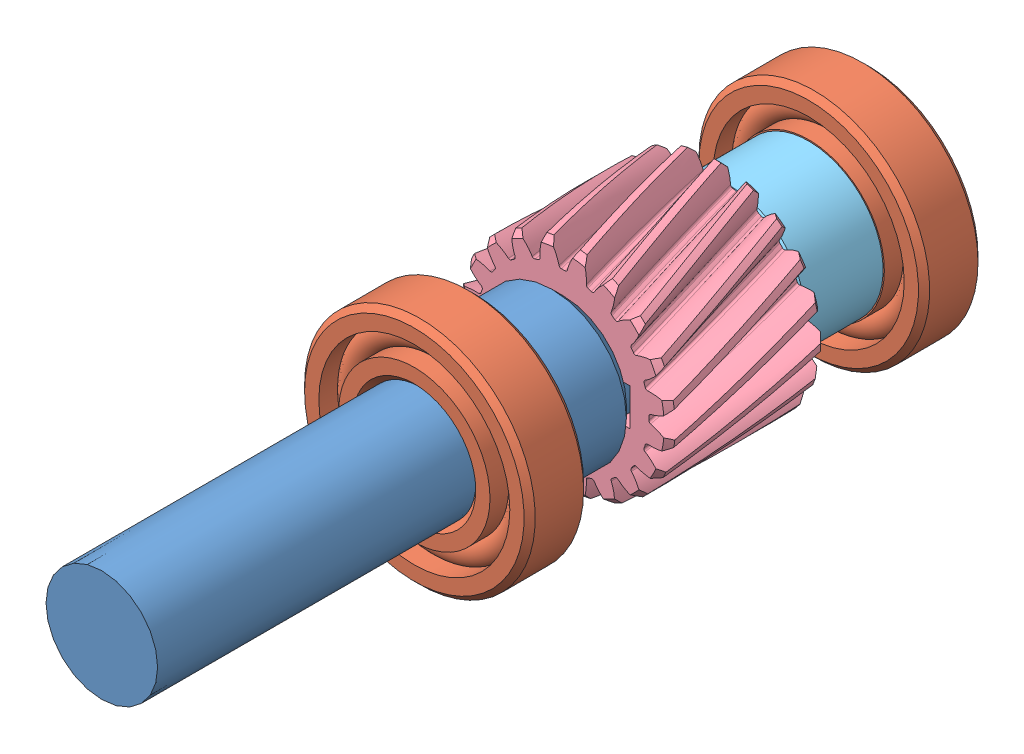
SolidWorks assembly Вал2+Подшипник+Шестерня.SLDASM, configuration По умолчанию (file format 9000). Lengths in mm.
Overall size (62 62 206).
6 component instances, 5 part files, 11 mates.
Components (placement in the parent):
- Вал2-1: Вал2.SLDPRT [По умолчанию] at (-2.2849 -1.5804 75.5) size (40 40 206)
- Bear 8995_176000_2_gost-1: Bear 8995_176000_2_gost.SLDPRT [Подшипник 176206 ГОСТ 8995-75] at (-2.2849 -1.5804 157.5) x (0 0 -1) z (1 0 0) size (16 62 62)
- Шпонка (10х6х15)-1: Шпонка (10х6х15).SLDPRT [По умолчанию] at (15.7151 -1.5494 95.7464) x (0 0 1) z (-1 0 0) size (15 10 6)
- Косозубая шестерня 1 (правое)-1: Косозубая шестерня 1 (правое).SLDPRT [PreviewCfg] at (-2.2849 -1.5804 117.5) x (0 0 -1) z (0 -1 0) size (42 57.38 57.38)
- Втулка-1: Втулка.SLDPRT [По умолчанию] at (-2.2849 -1.5804 51.5) size (40 40 24)
- Bear 8995_176000_2_gost-2: Bear 8995_176000_2_gost.SLDPRT [Подшипник 176206 ГОСТ 8995-75] at (-2.2849 -1.5804 51.5) x (0 0 -1) z (1 0 0) size (16 62 62)
Mates (geometry in assembly coordinates):
- Концентричный1: concentric anti-aligned: cylinder of Вал2-1 through (-2.2849 -1.5804 241.5) axis (0 0 -1) radius 15; cylinder of Bear 8995_176000_2_gost-1 through (-2.2849 -1.5804 157.5) axis (0 0 1) radius 15
- Совпадение1: coincident anti-aligned: plane of Вал2-1 through (-2.2849 -1.5804 141.5) normal (0 0 1); plane of Bear 8995_176000_2_gost-1 through (-2.2849 -1.5804 141.5) normal (0 0 -1)
- Совпадение2: coincident anti-aligned: plane of Вал2-1 through (9.7151 -1.5804 75.5) normal (1 0 0); plane of Шпонка (10х6х15)-1 through (9.7151 -1.5494 95.7464) normal (-1 0 0)
- Концентричный2: concentric anti-aligned: cylinder of Вал2-1 through (12.7151 -1.5494 98.2464) axis (-1 0 0) radius 5; cylinder of Шпонка (10х6х15)-1 through (9.7151 -1.5494 98.2464) axis (1 0 0) radius 5
- Концентричный3: concentric anti-aligned: cylinder of Вал2-1 through (-2.2849 -1.5804 117.5) axis (0 0 -1) radius 15; cylinder of Косозубая шестерня 1 (правое)-1 through (-2.2849 -1.5804 65) axis (0 0 1) radius 15
- Параллельность1: parallel anti-aligned: plane of Шпонка (10х6х15)-1 through (9.7151 3.4506 103.2464) normal (0 1 0); plane of Косозубая шестерня 1 (правое)-1 through (15.7151 3.4196 65) normal (0 -1 0)
- Совпадение4: coincident anti-aligned: plane of Вал2-1 through (-2.2849 -1.5804 117.5) normal (0 0 -1); plane of Косозубая шестерня 1 (правое)-1 through (-2.2849 -1.5804 117.5) normal (0 0 1)
- Концентричный4: concentric aligned: cylinder of Вал2-1 through (-2.2849 -1.5804 117.5) axis (0 0 -1) radius 15; cylinder of Втулка-1 through (-2.2849 -1.5804 75.5) axis (0 0 -1) radius 15
- Совпадение5: coincident anti-aligned: circle of Косозубая шестерня 1 (правое)-1; plane of Втулка-1 through (-2.2849 -1.5804 75.5) normal (0 0 1)
- Концентричный6: concentric anti-aligned: cylinder of Вал2-1 through (-2.2849 -1.5804 117.5) axis (0 0 -1) radius 15; cylinder of Bear 8995_176000_2_gost-2 through (-2.2849 -1.5804 51.5) axis (0 0 1) radius 15
- Совпадение6: coincident anti-aligned: plane of Втулка-1 through (-2.2849 -1.5804 51.5) normal (0 0 -1); plane of Bear 8995_176000_2_gost-2 through (-2.2849 -1.5804 51.5) normal (0 0 1)
